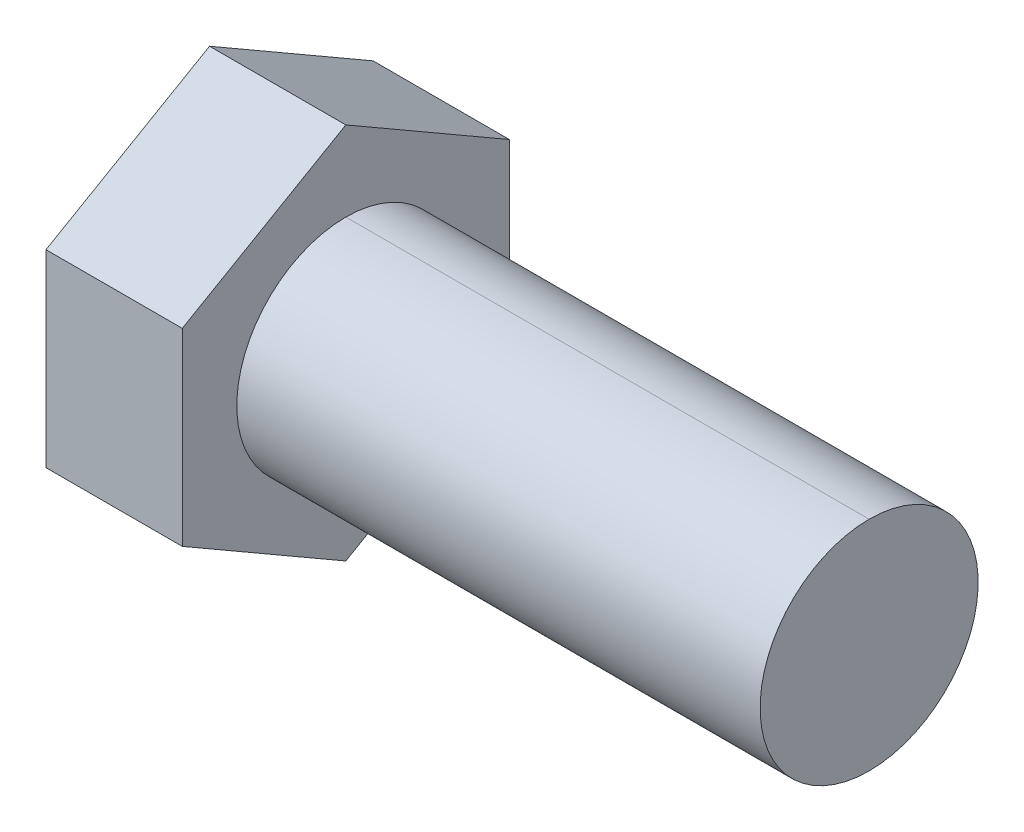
ISO-10303-21;
HEADER;
FILE_DESCRIPTION(('STEP AP214'),'2;1');
FILE_NAME('part.step','',(''),(''),'','','');
FILE_SCHEMA(('AUTOMOTIVE_DESIGN { 1 0 10303 214 1 1 1 1 }'));
ENDSEC;
DATA;
#1=APPLICATION_CONTEXT('core data for automotive mechanical design processes');
#2=APPLICATION_PROTOCOL_DEFINITION('international standard','automotive_design',2000,#1);
#3=PRODUCT_CONTEXT('',#1,'mechanical');
#4=PRODUCT('Part','Part','',(#3));
#5=PRODUCT_RELATED_PRODUCT_CATEGORY('part','',(#4));
#6=PRODUCT_DEFINITION_FORMATION('','',#4);
#7=PRODUCT_DEFINITION_CONTEXT('part definition',#1,'design');
#8=PRODUCT_DEFINITION('design','',#6,#7);
#9=PRODUCT_DEFINITION_SHAPE('','',#8);
#10=(LENGTH_UNIT() NAMED_UNIT(*) SI_UNIT(.MILLI.,.METRE.));
#11=(NAMED_UNIT(*) PLANE_ANGLE_UNIT() SI_UNIT($,.RADIAN.));
#12=(NAMED_UNIT(*) SI_UNIT($,.STERADIAN.) SOLID_ANGLE_UNIT());
#13=UNCERTAINTY_MEASURE_WITH_UNIT(LENGTH_MEASURE(1.E-05),#10,'distance_accuracy_value','');
#14=(GEOMETRIC_REPRESENTATION_CONTEXT(3) GLOBAL_UNCERTAINTY_ASSIGNED_CONTEXT((#13)) GLOBAL_UNIT_ASSIGNED_CONTEXT((#10,
#11,#12)) REPRESENTATION_CONTEXT('',''));
#15=CARTESIAN_POINT('',(0.,0.,0.));
#16=DIRECTION('',(0.,0.,1.));
#17=DIRECTION('',(1.,0.,0.));
#18=AXIS2_PLACEMENT_3D('',#15,#16,#17);
#19=CARTESIAN_POINT('',(-19.2087499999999,5.49926131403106,9.525));
#20=DIRECTION('',(1.,0.,0.));
#21=DIRECTION('',(0.,1.,0.));
#22=AXIS2_PLACEMENT_3D('',#19,#20,#21);
#23=PLANE('',#22);
#24=DIRECTION('',(0.,-0.500000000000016,0.866025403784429));
#25=VECTOR('',#24,1.);
#26=CARTESIAN_POINT('',(-19.2087499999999,10.9985226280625,0.));
#27=LINE('',#26,#25);
#28=CARTESIAN_POINT('',(-19.2087499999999,10.9985226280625,0.));
#29=VERTEX_POINT('',#28);
#30=CARTESIAN_POINT('',(-19.2087499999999,5.49926131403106,9.525));
#31=VERTEX_POINT('',#30);
#32=EDGE_CURVE('E90',#29,#31,#27,.T.);
#33=ORIENTED_EDGE('',*,*,#32,.F.);
#34=DIRECTION('',(0.,0.500000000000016,0.866025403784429));
#35=VECTOR('',#34,1.);
#36=CARTESIAN_POINT('',(-19.2087499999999,5.49926131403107,-9.525));
#37=LINE('',#36,#35);
#38=CARTESIAN_POINT('',(-19.2087499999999,5.49926131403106,-9.525));
#39=VERTEX_POINT('',#38);
#40=EDGE_CURVE('E138',#39,#29,#37,.T.);
#41=ORIENTED_EDGE('',*,*,#40,.F.);
#42=DIRECTION('',(0.,1.,0.));
#43=VECTOR('',#42,1.);
#44=CARTESIAN_POINT('',(-19.2087499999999,-5.49926131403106,-9.525));
#45=LINE('',#44,#43);
#46=CARTESIAN_POINT('',(-19.2087499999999,-5.49926131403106,-9.525));
#47=VERTEX_POINT('',#46);
#48=EDGE_CURVE('E143',#47,#39,#45,.T.);
#49=ORIENTED_EDGE('',*,*,#48,.F.);
#50=DIRECTION('',(0.,0.500000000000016,-0.866025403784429));
#51=VECTOR('',#50,1.);
#52=CARTESIAN_POINT('',(-19.2087499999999,-10.9985226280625,0.));
#53=LINE('',#52,#51);
#54=CARTESIAN_POINT('',(-19.2087499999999,-10.9985226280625,0.));
#55=VERTEX_POINT('',#54);
#56=EDGE_CURVE('E148',#55,#47,#53,.T.);
#57=ORIENTED_EDGE('',*,*,#56,.F.);
#58=DIRECTION('',(0.,-0.500000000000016,-0.866025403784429));
#59=VECTOR('',#58,1.);
#60=CARTESIAN_POINT('',(-19.2087499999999,-5.49926131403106,9.525));
#61=LINE('',#60,#59);
#62=CARTESIAN_POINT('',(-19.2087499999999,-5.49926131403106,9.525));
#63=VERTEX_POINT('',#62);
#64=EDGE_CURVE('E86',#63,#55,#61,.T.);
#65=ORIENTED_EDGE('',*,*,#64,.F.);
#66=DIRECTION('',(0.,1.,0.));
#67=VECTOR('',#66,1.);
#68=CARTESIAN_POINT('',(-19.2087499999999,5.49926131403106,9.525));
#69=LINE('',#68,#67);
#70=EDGE_CURVE('E88',#31,#63,#69,.F.);
#71=ORIENTED_EDGE('',*,*,#70,.F.);
#72=EDGE_LOOP('',(#33,#41,#49,#57,#65,#71));
#73=FACE_BOUND('',#72,.T.);
#74=ADVANCED_FACE('F16',(#73),#23,.F.);
#75=CARTESIAN_POINT('',(-11.2712499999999,10.9985226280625,0.));
#76=DIRECTION('',(0.,0.866025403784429,0.500000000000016));
#77=DIRECTION('',(0.,-0.500000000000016,0.866025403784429));
#78=AXIS2_PLACEMENT_3D('',#75,#76,#77);
#79=PLANE('',#78);
#80=DIRECTION('',(0.,-0.500000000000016,0.866025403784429));
#81=VECTOR('',#80,1.);
#82=CARTESIAN_POINT('',(-11.2712499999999,10.9985226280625,0.));
#83=LINE('',#82,#81);
#84=CARTESIAN_POINT('',(-11.2712499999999,10.9985226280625,0.));
#85=VERTEX_POINT('',#84);
#86=CARTESIAN_POINT('',(-11.2712499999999,5.49926131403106,9.525));
#87=VERTEX_POINT('',#86);
#88=EDGE_CURVE('E132',#85,#87,#83,.T.);
#89=ORIENTED_EDGE('',*,*,#88,.F.);
#90=DIRECTION('',(1.,0.,0.));
#91=VECTOR('',#90,1.);
#92=CARTESIAN_POINT('',(-11.2712499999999,10.9985226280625,0.));
#93=LINE('',#92,#91);
#94=EDGE_CURVE('E101',#29,#85,#93,.T.);
#95=ORIENTED_EDGE('',*,*,#94,.F.);
#96=ORIENTED_EDGE('',*,*,#32,.T.);
#97=DIRECTION('',(1.,0.,0.));
#98=VECTOR('',#97,1.);
#99=CARTESIAN_POINT('',(-11.2712499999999,5.49926131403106,9.525));
#100=LINE('',#99,#98);
#101=EDGE_CURVE('E95',#87,#31,#100,.F.);
#102=ORIENTED_EDGE('',*,*,#101,.F.);
#103=EDGE_LOOP('',(#89,#95,#96,#102));
#104=FACE_BOUND('',#103,.T.);
#105=ADVANCED_FACE('F98',(#104),#79,.T.);
#106=CARTESIAN_POINT('',(-11.2712499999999,5.49926131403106,9.525));
#107=DIRECTION('',(0.,0.,1.));
#108=DIRECTION('',(1.,0.,0.));
#109=AXIS2_PLACEMENT_3D('',#106,#107,#108);
#110=PLANE('',#109);
#111=DIRECTION('',(0.,1.,0.));
#112=VECTOR('',#111,1.);
#113=CARTESIAN_POINT('',(-11.2712499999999,0.,9.525));
#114=LINE('',#113,#112);
#115=CARTESIAN_POINT('',(-11.2712499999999,-5.49926131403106,9.525));
#116=VERTEX_POINT('',#115);
#117=EDGE_CURVE('E106',#87,#116,#114,.F.);
#118=ORIENTED_EDGE('',*,*,#117,.F.);
#119=ORIENTED_EDGE('',*,*,#101,.T.);
#120=ORIENTED_EDGE('',*,*,#70,.T.);
#121=DIRECTION('',(1.,0.,0.));
#122=VECTOR('',#121,1.);
#123=CARTESIAN_POINT('',(-11.2712499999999,-5.49926131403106,9.525));
#124=LINE('',#123,#122);
#125=EDGE_CURVE('E109',#116,#63,#124,.F.);
#126=ORIENTED_EDGE('',*,*,#125,.F.);
#127=EDGE_LOOP('',(#118,#119,#120,#126));
#128=FACE_BOUND('',#127,.T.);
#129=ADVANCED_FACE('F104',(#128),#110,.T.);
#130=CARTESIAN_POINT('',(-11.2712499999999,-5.49926131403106,9.525));
#131=DIRECTION('',(0.,-0.866025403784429,0.500000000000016));
#132=DIRECTION('',(0.,-0.500000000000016,-0.866025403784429));
#133=AXIS2_PLACEMENT_3D('',#130,#131,#132);
#134=PLANE('',#133);
#135=DIRECTION('',(0.,-0.500000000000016,-0.866025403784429));
#136=VECTOR('',#135,1.);
#137=CARTESIAN_POINT('',(-11.2712499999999,-5.49926131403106,9.525));
#138=LINE('',#137,#136);
#139=CARTESIAN_POINT('',(-11.2712499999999,-10.9985226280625,0.));
#140=VERTEX_POINT('',#139);
#141=EDGE_CURVE('E128',#116,#140,#138,.T.);
#142=ORIENTED_EDGE('',*,*,#141,.F.);
#143=ORIENTED_EDGE('',*,*,#125,.T.);
#144=ORIENTED_EDGE('',*,*,#64,.T.);
#145=DIRECTION('',(1.,0.,0.));
#146=VECTOR('',#145,1.);
#147=CARTESIAN_POINT('',(-11.2712499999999,-10.9985226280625,0.));
#148=LINE('',#147,#146);
#149=EDGE_CURVE('E145',#140,#55,#148,.F.);
#150=ORIENTED_EDGE('',*,*,#149,.F.);
#151=EDGE_LOOP('',(#142,#143,#144,#150));
#152=FACE_BOUND('',#151,.T.);
#153=ADVANCED_FACE('F152',(#152),#134,.T.);
#154=CARTESIAN_POINT('',(-11.2712499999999,-10.9985226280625,0.));
#155=DIRECTION('',(0.,-0.866025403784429,-0.500000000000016));
#156=DIRECTION('',(0.,0.500000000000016,-0.866025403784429));
#157=AXIS2_PLACEMENT_3D('',#154,#155,#156);
#158=PLANE('',#157);
#159=DIRECTION('',(0.,0.500000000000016,-0.866025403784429));
#160=VECTOR('',#159,1.);
#161=CARTESIAN_POINT('',(-11.2712499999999,-10.9985226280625,0.));
#162=LINE('',#161,#160);
#163=CARTESIAN_POINT('',(-11.2712499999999,-5.49926131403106,-9.525));
#164=VERTEX_POINT('',#163);
#165=EDGE_CURVE('E123',#140,#164,#162,.T.);
#166=ORIENTED_EDGE('',*,*,#165,.F.);
#167=ORIENTED_EDGE('',*,*,#149,.T.);
#168=ORIENTED_EDGE('',*,*,#56,.T.);
#169=DIRECTION('',(-1.,0.,0.));
#170=VECTOR('',#169,1.);
#171=CARTESIAN_POINT('',(-11.2712499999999,-5.49926131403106,-9.525));
#172=LINE('',#171,#170);
#173=EDGE_CURVE('E140',#164,#47,#172,.T.);
#174=ORIENTED_EDGE('',*,*,#173,.F.);
#175=EDGE_LOOP('',(#166,#167,#168,#174));
#176=FACE_BOUND('',#175,.T.);
#177=ADVANCED_FACE('F159',(#176),#158,.T.);
#178=CARTESIAN_POINT('',(-11.2712499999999,-5.49926131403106,-9.525));
#179=DIRECTION('',(0.,0.,-1.));
#180=DIRECTION('',(-1.,0.,0.));
#181=AXIS2_PLACEMENT_3D('',#178,#179,#180);
#182=PLANE('',#181);
#183=DIRECTION('',(0.,1.,0.));
#184=VECTOR('',#183,1.);
#185=CARTESIAN_POINT('',(-11.2712499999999,0.,-9.525));
#186=LINE('',#185,#184);
#187=CARTESIAN_POINT('',(-11.2712499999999,5.49926131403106,-9.525));
#188=VERTEX_POINT('',#187);
#189=EDGE_CURVE('E119',#164,#188,#186,.T.);
#190=ORIENTED_EDGE('',*,*,#189,.F.);
#191=ORIENTED_EDGE('',*,*,#173,.T.);
#192=ORIENTED_EDGE('',*,*,#48,.T.);
#193=DIRECTION('',(1.,0.,0.));
#194=VECTOR('',#193,1.);
#195=CARTESIAN_POINT('',(-11.2712499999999,5.49926131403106,-9.525));
#196=LINE('',#195,#194);
#197=EDGE_CURVE('E53',#188,#39,#196,.F.);
#198=ORIENTED_EDGE('',*,*,#197,.F.);
#199=EDGE_LOOP('',(#190,#191,#192,#198));
#200=FACE_BOUND('',#199,.T.);
#201=ADVANCED_FACE('F157',(#200),#182,.T.);
#202=CARTESIAN_POINT('',(-11.2712499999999,5.49926131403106,-9.525));
#203=DIRECTION('',(0.,0.866025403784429,-0.500000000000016));
#204=DIRECTION('',(0.,0.500000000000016,0.866025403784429));
#205=AXIS2_PLACEMENT_3D('',#202,#203,#204);
#206=PLANE('',#205);
#207=DIRECTION('',(0.,0.500000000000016,0.866025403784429));
#208=VECTOR('',#207,1.);
#209=CARTESIAN_POINT('',(-11.2712499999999,5.49926131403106,-9.525));
#210=LINE('',#209,#208);
#211=EDGE_CURVE('E115',#188,#85,#210,.T.);
#212=ORIENTED_EDGE('',*,*,#211,.F.);
#213=ORIENTED_EDGE('',*,*,#197,.T.);
#214=ORIENTED_EDGE('',*,*,#40,.T.);
#215=ORIENTED_EDGE('',*,*,#94,.T.);
#216=EDGE_LOOP('',(#212,#213,#214,#215));
#217=FACE_BOUND('',#216,.T.);
#218=ADVANCED_FACE('F156',(#217),#206,.T.);
#219=CARTESIAN_POINT('',(19.2087499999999,0.,0.));
#220=DIRECTION('',(1.,0.,0.));
#221=DIRECTION('',(0.,1.,0.));
#222=AXIS2_PLACEMENT_3D('',#219,#220,#221);
#223=PLANE('',#222);
#224=CARTESIAN_POINT('',(19.2087499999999,0.,0.));
#225=DIRECTION('',(-1.,0.,0.));
#226=DIRECTION('',(0.,-1.,0.));
#227=AXIS2_PLACEMENT_3D('',#224,#225,#226);
#228=CIRCLE('',#227,6.35);
#229=CARTESIAN_POINT('',(19.2087499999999,-6.35,0.));
#230=VERTEX_POINT('',#229);
#231=CARTESIAN_POINT('',(19.2087499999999,6.35,0.));
#232=VERTEX_POINT('',#231);
#233=EDGE_CURVE('E113',#230,#232,#228,.T.);
#234=ORIENTED_EDGE('',*,*,#233,.F.);
#235=CARTESIAN_POINT('',(19.2087499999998,0.,0.));
#236=DIRECTION('',(-1.,0.,0.));
#237=DIRECTION('',(0.,-1.,0.));
#238=AXIS2_PLACEMENT_3D('',#235,#236,#237);
#239=CIRCLE('',#238,6.35);
#240=EDGE_CURVE('E19',#232,#230,#239,.T.);
#241=ORIENTED_EDGE('',*,*,#240,.F.);
#242=EDGE_LOOP('',(#234,#241));
#243=FACE_BOUND('',#242,.T.);
#244=ADVANCED_FACE('F181',(#243),#223,.T.);
#245=CARTESIAN_POINT('',(6.50874999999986,0.,0.));
#246=DIRECTION('',(-1.,0.,0.));
#247=DIRECTION('',(0.,-1.,0.));
#248=AXIS2_PLACEMENT_3D('',#245,#246,#247);
#249=CYLINDRICAL_SURFACE('',#248,6.35);
#250=DIRECTION('',(-1.,0.,0.));
#251=VECTOR('',#250,1.);
#252=CARTESIAN_POINT('',(6.50874999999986,6.35,0.));
#253=LINE('',#252,#251);
#254=CARTESIAN_POINT('',(-11.2712500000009,6.35,0.));
#255=VERTEX_POINT('',#254);
#256=EDGE_CURVE('E25',#232,#255,#253,.T.);
#257=ORIENTED_EDGE('',*,*,#256,.F.);
#258=ORIENTED_EDGE('',*,*,#240,.T.);
#259=DIRECTION('',(-1.,0.,0.));
#260=VECTOR('',#259,1.);
#261=CARTESIAN_POINT('',(6.50874999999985,-6.35,0.));
#262=LINE('',#261,#260);
#263=CARTESIAN_POINT('',(-11.2712500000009,-6.35,0.));
#264=VERTEX_POINT('',#263);
#265=EDGE_CURVE('E45',#264,#230,#262,.F.);
#266=ORIENTED_EDGE('',*,*,#265,.F.);
#267=CARTESIAN_POINT('',(-11.2712500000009,0.,0.));
#268=DIRECTION('',(-1.,0.,0.));
#269=DIRECTION('',(0.,-1.,0.));
#270=AXIS2_PLACEMENT_3D('',#267,#268,#269);
#271=CIRCLE('',#270,6.35);
#272=EDGE_CURVE('E34',#255,#264,#271,.T.);
#273=ORIENTED_EDGE('',*,*,#272,.F.);
#274=EDGE_LOOP('',(#257,#258,#266,#273));
#275=FACE_BOUND('',#274,.T.);
#276=ADVANCED_FACE('F176',(#275),#249,.T.);
#277=CARTESIAN_POINT('',(-11.2712499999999,0.,0.));
#278=DIRECTION('',(1.,0.,0.));
#279=DIRECTION('',(0.,1.,0.));
#280=AXIS2_PLACEMENT_3D('',#277,#278,#279);
#281=PLANE('',#280);
#282=ORIENTED_EDGE('',*,*,#272,.T.);
#283=CARTESIAN_POINT('',(-11.2712500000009,0.,0.));
#284=DIRECTION('',(-1.,0.,0.));
#285=DIRECTION('',(0.,-1.,0.));
#286=AXIS2_PLACEMENT_3D('',#283,#284,#285);
#287=CIRCLE('',#286,6.35);
#288=EDGE_CURVE('E11',#255,#264,#287,.F.);
#289=ORIENTED_EDGE('',*,*,#288,.F.);
#290=EDGE_LOOP('',(#282,#289));
#291=FACE_BOUND('',#290,.T.);
#292=ORIENTED_EDGE('',*,*,#189,.T.);
#293=ORIENTED_EDGE('',*,*,#211,.T.);
#294=ORIENTED_EDGE('',*,*,#88,.T.);
#295=ORIENTED_EDGE('',*,*,#117,.T.);
#296=ORIENTED_EDGE('',*,*,#141,.T.);
#297=ORIENTED_EDGE('',*,*,#165,.T.);
#298=EDGE_LOOP('',(#292,#293,#294,#295,#296,#297));
#299=FACE_BOUND('',#298,.T.);
#300=ADVANCED_FACE('F154',(#291,#299),#281,.T.);
#301=CARTESIAN_POINT('',(6.50874999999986,0.,0.));
#302=DIRECTION('',(-1.,0.,0.));
#303=DIRECTION('',(0.,-1.,0.));
#304=AXIS2_PLACEMENT_3D('',#301,#302,#303);
#305=CYLINDRICAL_SURFACE('',#304,6.35);
#306=ORIENTED_EDGE('',*,*,#256,.T.);
#307=ORIENTED_EDGE('',*,*,#288,.T.);
#308=ORIENTED_EDGE('',*,*,#265,.T.);
#309=ORIENTED_EDGE('',*,*,#233,.T.);
#310=EDGE_LOOP('',(#306,#307,#308,#309));
#311=FACE_BOUND('',#310,.T.);
#312=ADVANCED_FACE('F169',(#311),#305,.T.);
#313=CLOSED_SHELL('',(#74,#105,#129,#153,#177,#201,#218,#244,#276,#300,#312));
#314=MANIFOLD_SOLID_BREP('B1',#313);
#315=ADVANCED_BREP_SHAPE_REPRESENTATION('',(#18,#314),#14);
#316=SHAPE_DEFINITION_REPRESENTATION(#9,#315);
ENDSEC;
END-ISO-10303-21;
